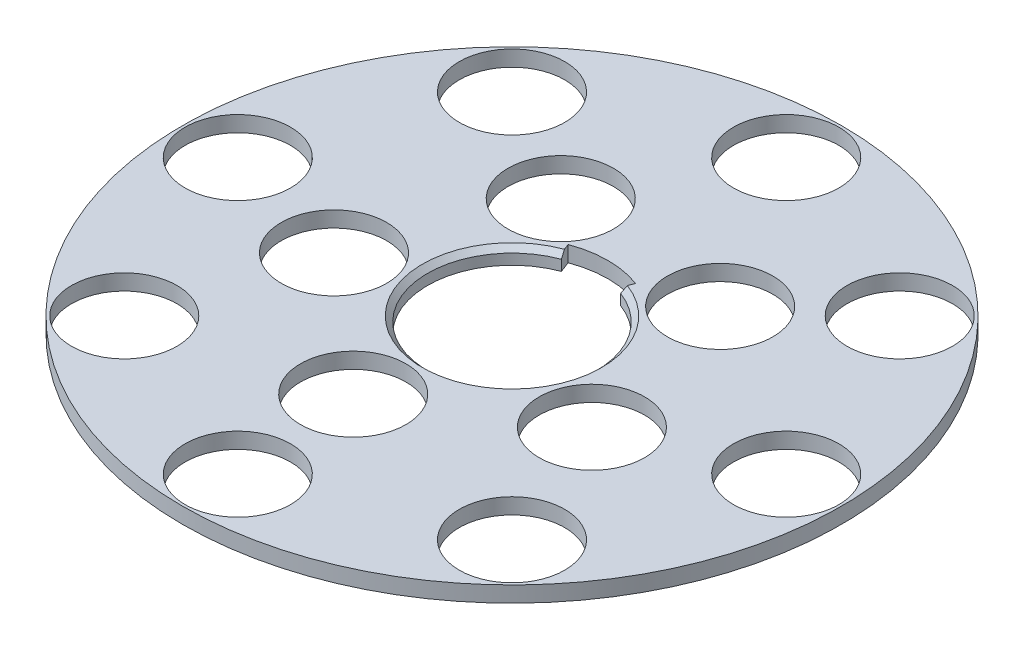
ISO-10303-21;
HEADER;
FILE_DESCRIPTION(('STEP AP214'),'2;1');
FILE_NAME('part.step','',(''),(''),'','','');
FILE_SCHEMA(('AUTOMOTIVE_DESIGN { 1 0 10303 214 1 1 1 1 }'));
ENDSEC;
DATA;
#1=APPLICATION_CONTEXT('core data for automotive mechanical design processes');
#2=APPLICATION_PROTOCOL_DEFINITION('international standard','automotive_design',2000,#1);
#3=PRODUCT_CONTEXT('',#1,'mechanical');
#4=PRODUCT('Part','Part','',(#3));
#5=PRODUCT_RELATED_PRODUCT_CATEGORY('part','',(#4));
#6=PRODUCT_DEFINITION_FORMATION('','',#4);
#7=PRODUCT_DEFINITION_CONTEXT('part definition',#1,'design');
#8=PRODUCT_DEFINITION('design','',#6,#7);
#9=PRODUCT_DEFINITION_SHAPE('','',#8);
#10=(LENGTH_UNIT() NAMED_UNIT(*) SI_UNIT(.MILLI.,.METRE.));
#11=(NAMED_UNIT(*) PLANE_ANGLE_UNIT() SI_UNIT($,.RADIAN.));
#12=(NAMED_UNIT(*) SI_UNIT($,.STERADIAN.) SOLID_ANGLE_UNIT());
#13=UNCERTAINTY_MEASURE_WITH_UNIT(LENGTH_MEASURE(1.E-05),#10,'distance_accuracy_value','');
#14=(GEOMETRIC_REPRESENTATION_CONTEXT(3) GLOBAL_UNCERTAINTY_ASSIGNED_CONTEXT((#13)) GLOBAL_UNIT_ASSIGNED_CONTEXT((#10,
#11,#12)) REPRESENTATION_CONTEXT('',''));
#15=CARTESIAN_POINT('',(0.,0.,0.));
#16=DIRECTION('',(0.,0.,1.));
#17=DIRECTION('',(1.,0.,0.));
#18=AXIS2_PLACEMENT_3D('',#15,#16,#17);
#19=CARTESIAN_POINT('',(0.,-1.5,0.));
#20=DIRECTION('',(0.,1.,0.));
#21=DIRECTION('',(0.,0.,1.));
#22=AXIS2_PLACEMENT_3D('',#19,#20,#21);
#23=CYLINDRICAL_SURFACE('',#22,31.25);
#24=CARTESIAN_POINT('',(0.,-1.5,0.));
#25=DIRECTION('',(0.,1.,0.));
#26=DIRECTION('',(0.,0.,1.));
#27=AXIS2_PLACEMENT_3D('',#24,#25,#26);
#28=CIRCLE('',#27,31.25);
#29=CARTESIAN_POINT('',(0.,-1.5,31.25));
#30=VERTEX_POINT('',#29);
#31=EDGE_CURVE('E123',#30,#30,#28,.T.);
#32=ORIENTED_EDGE('',*,*,#31,.T.);
#33=EDGE_LOOP('',(#32));
#34=FACE_BOUND('',#33,.T.);
#35=CARTESIAN_POINT('',(0.,0.,0.));
#36=DIRECTION('',(0.,1.,0.));
#37=DIRECTION('',(0.,0.,1.));
#38=AXIS2_PLACEMENT_3D('',#35,#36,#37);
#39=CIRCLE('',#38,31.25);
#40=CARTESIAN_POINT('',(0.,0.,31.25));
#41=VERTEX_POINT('',#40);
#42=EDGE_CURVE('E118',#41,#41,#39,.T.);
#43=ORIENTED_EDGE('',*,*,#42,.F.);
#44=EDGE_LOOP('',(#43));
#45=FACE_BOUND('',#44,.T.);
#46=ADVANCED_FACE('F34',(#34,#45),#23,.T.);
#47=CARTESIAN_POINT('',(0.,-1.5,0.));
#48=DIRECTION('',(0.,1.,0.));
#49=DIRECTION('',(0.,0.,1.));
#50=AXIS2_PLACEMENT_3D('',#47,#48,#49);
#51=PLANE('',#50);
#52=CARTESIAN_POINT('',(-1.09842734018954,-1.5,13.9568426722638));
#53=DIRECTION('',(0.,1.,0.));
#54=DIRECTION('',(-0.95105651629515,0.,0.309016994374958));
#55=AXIS2_PLACEMENT_3D('',#52,#53,#54);
#56=CIRCLE('',#55,5.);
#57=CARTESIAN_POINT('',(-5.85370992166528,-1.5,15.5019276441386));
#58=VERTEX_POINT('',#57);
#59=EDGE_CURVE('E217',#58,#58,#56,.T.);
#60=ORIENTED_EDGE('',*,*,#59,.T.);
#61=EDGE_LOOP('',(#60));
#62=FACE_BOUND('',#61,.T.);
#63=CARTESIAN_POINT('',(-13.6131788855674,-1.5,3.26823509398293));
#64=DIRECTION('',(0.,1.,0.));
#65=DIRECTION('',(-0.58778525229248,0.,-0.809016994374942));
#66=AXIS2_PLACEMENT_3D('',#63,#64,#65);
#67=CIRCLE('',#66,5.);
#68=CARTESIAN_POINT('',(-16.5521051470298,-1.5,-0.776849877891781));
#69=VERTEX_POINT('',#68);
#70=EDGE_CURVE('E225',#69,#69,#67,.T.);
#71=ORIENTED_EDGE('',*,*,#70,.T.);
#72=EDGE_LOOP('',(#71));
#73=FACE_BOUND('',#72,.T.);
#74=CARTESIAN_POINT('',(-7.31497990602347,-1.5,-11.9369623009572));
#75=DIRECTION('',(0.,1.,0.));
#76=DIRECTION('',(0.587785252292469,0.,-0.809016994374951));
#77=AXIS2_PLACEMENT_3D('',#74,#75,#76);
#78=CIRCLE('',#77,5.);
#79=CARTESIAN_POINT('',(-4.37605364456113,-1.5,-15.9820472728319));
#80=VERTEX_POINT('',#79);
#81=EDGE_CURVE('E231',#80,#80,#78,.T.);
#82=ORIENTED_EDGE('',*,*,#81,.T.);
#83=EDGE_LOOP('',(#82));
#84=FACE_BOUND('',#83,.T.);
#85=CARTESIAN_POINT('',(9.09227267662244,-1.5,-10.6456835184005));
#86=DIRECTION('',(0.,1.,0.));
#87=DIRECTION('',(0.951056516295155,0.,0.309016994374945));
#88=AXIS2_PLACEMENT_3D('',#85,#86,#87);
#89=CIRCLE('',#88,5.);
#90=CARTESIAN_POINT('',(13.8475552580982,-1.5,-9.10059854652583));
#91=VERTEX_POINT('',#90);
#92=EDGE_CURVE('E237',#91,#91,#89,.T.);
#93=ORIENTED_EDGE('',*,*,#92,.T.);
#94=EDGE_LOOP('',(#93));
#95=FACE_BOUND('',#94,.T.);
#96=CARTESIAN_POINT('',(12.9343134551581,-1.5,5.35756805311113));
#97=DIRECTION('',(0.,1.,0.));
#98=DIRECTION('',(0.,0.,1.));
#99=AXIS2_PLACEMENT_3D('',#96,#97,#98);
#100=CIRCLE('',#99,5.);
#101=CARTESIAN_POINT('',(12.9343134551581,-1.5,10.3575680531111));
#102=VERTEX_POINT('',#101);
#103=EDGE_CURVE('E243',#102,#102,#100,.T.);
#104=ORIENTED_EDGE('',*,*,#103,.T.);
#105=EDGE_LOOP('',(#104));
#106=FACE_BOUND('',#105,.T.);
#107=CARTESIAN_POINT('',(18.38477631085,-1.5,-18.3847763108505));
#108=DIRECTION('',(0.,1.,0.));
#109=DIRECTION('',(-0.707106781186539,0.,0.707106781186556));
#110=AXIS2_PLACEMENT_3D('',#107,#108,#109);
#111=CIRCLE('',#110,5.);
#112=CARTESIAN_POINT('',(14.8492424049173,-1.5,-14.8492424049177));
#113=VERTEX_POINT('',#112);
#114=EDGE_CURVE('E249',#113,#113,#111,.T.);
#115=ORIENTED_EDGE('',*,*,#114,.T.);
#116=EDGE_LOOP('',(#115));
#117=FACE_BOUND('',#116,.T.);
#118=CARTESIAN_POINT('',(26.,-1.5,-2.72335544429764E-13));
#119=DIRECTION('',(0.,1.,0.));
#120=DIRECTION('',(-1.,0.,0.));
#121=AXIS2_PLACEMENT_3D('',#118,#119,#120);
#122=CIRCLE('',#121,5.);
#123=CARTESIAN_POINT('',(21.,-1.5,-2.19963324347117E-13));
#124=VERTEX_POINT('',#123);
#125=EDGE_CURVE('E255',#124,#124,#122,.T.);
#126=ORIENTED_EDGE('',*,*,#125,.T.);
#127=EDGE_LOOP('',(#126));
#128=FACE_BOUND('',#127,.T.);
#129=CARTESIAN_POINT('',(18.3847763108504,-1.5,18.3847763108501));
#130=DIRECTION('',(0.,1.,0.));
#131=DIRECTION('',(-0.707106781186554,0.,-0.707106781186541));
#132=AXIS2_PLACEMENT_3D('',#129,#130,#131);
#133=CIRCLE('',#132,5.);
#134=CARTESIAN_POINT('',(14.8492424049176,-1.5,14.8492424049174));
#135=VERTEX_POINT('',#134);
#136=EDGE_CURVE('E261',#135,#135,#133,.T.);
#137=ORIENTED_EDGE('',*,*,#136,.T.);
#138=EDGE_LOOP('',(#137));
#139=FACE_BOUND('',#138,.T.);
#140=CARTESIAN_POINT('',(0.,-1.5,26.));
#141=DIRECTION('',(0.,1.,0.));
#142=DIRECTION('',(0.,0.,-1.));
#143=AXIS2_PLACEMENT_3D('',#140,#141,#142);
#144=CIRCLE('',#143,5.);
#145=CARTESIAN_POINT('',(0.,-1.5,21.));
#146=VERTEX_POINT('',#145);
#147=EDGE_CURVE('E267',#146,#146,#144,.T.);
#148=ORIENTED_EDGE('',*,*,#147,.T.);
#149=EDGE_LOOP('',(#148));
#150=FACE_BOUND('',#149,.T.);
#151=CARTESIAN_POINT('',(-18.3847763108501,-1.5,18.3847763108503));
#152=DIRECTION('',(0.,1.,0.));
#153=DIRECTION('',(0.707106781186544,0.,-0.707106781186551));
#154=AXIS2_PLACEMENT_3D('',#151,#152,#153);
#155=CIRCLE('',#154,5.);
#156=CARTESIAN_POINT('',(-14.8492424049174,-1.5,14.8492424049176));
#157=VERTEX_POINT('',#156);
#158=EDGE_CURVE('E273',#157,#157,#155,.T.);
#159=ORIENTED_EDGE('',*,*,#158,.T.);
#160=EDGE_LOOP('',(#159));
#161=FACE_BOUND('',#160,.T.);
#162=CARTESIAN_POINT('',(-26.,-1.5,0.));
#163=DIRECTION('',(0.,1.,0.));
#164=DIRECTION('',(1.,0.,0.));
#165=AXIS2_PLACEMENT_3D('',#162,#163,#164);
#166=CIRCLE('',#165,5.);
#167=CARTESIAN_POINT('',(-21.,-1.5,0.));
#168=VERTEX_POINT('',#167);
#169=EDGE_CURVE('E279',#168,#168,#166,.T.);
#170=ORIENTED_EDGE('',*,*,#169,.T.);
#171=EDGE_LOOP('',(#170));
#172=FACE_BOUND('',#171,.T.);
#173=CARTESIAN_POINT('',(-18.3847763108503,-1.5,-18.3847763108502));
#174=DIRECTION('',(0.,1.,0.));
#175=DIRECTION('',(0.707106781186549,0.,0.707106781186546));
#176=AXIS2_PLACEMENT_3D('',#173,#174,#175);
#177=CIRCLE('',#176,5.);
#178=CARTESIAN_POINT('',(-14.8492424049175,-1.5,-14.8492424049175));
#179=VERTEX_POINT('',#178);
#180=EDGE_CURVE('E285',#179,#179,#177,.T.);
#181=ORIENTED_EDGE('',*,*,#180,.T.);
#182=EDGE_LOOP('',(#181));
#183=FACE_BOUND('',#182,.T.);
#184=CARTESIAN_POINT('',(0.,-1.5,-26.));
#185=DIRECTION('',(0.,1.,0.));
#186=DIRECTION('',(0.,0.,1.));
#187=AXIS2_PLACEMENT_3D('',#184,#185,#186);
#188=CIRCLE('',#187,5.);
#189=CARTESIAN_POINT('',(0.,-1.5,-21.));
#190=VERTEX_POINT('',#189);
#191=EDGE_CURVE('E114',#190,#190,#188,.T.);
#192=ORIENTED_EDGE('',*,*,#191,.T.);
#193=EDGE_LOOP('',(#192));
#194=FACE_BOUND('',#193,.T.);
#195=CARTESIAN_POINT('',(0.,-1.5,0.));
#196=DIRECTION('',(0.,1.,0.));
#197=DIRECTION('',(0.,0.,1.));
#198=AXIS2_PLACEMENT_3D('',#195,#196,#197);
#199=CIRCLE('',#198,8.);
#200=CARTESIAN_POINT('',(-2.80898753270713,-1.5,-7.49063342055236));
#201=VERTEX_POINT('',#200);
#202=CARTESIAN_POINT('',(2.80898753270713,-1.5,-7.49063342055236));
#203=VERTEX_POINT('',#202);
#204=EDGE_CURVE('E89',#201,#203,#199,.T.);
#205=ORIENTED_EDGE('',*,*,#204,.T.);
#206=DIRECTION('',(0.351123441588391,0.,-0.936329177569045));
#207=VECTOR('',#206,1.);
#208=CARTESIAN_POINT('',(3.,-1.5,-8.));
#209=LINE('',#208,#207);
#210=CARTESIAN_POINT('',(3.19522331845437,-1.5,-8.5205955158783));
#211=VERTEX_POINT('',#210);
#212=EDGE_CURVE('E82',#203,#211,#209,.T.);
#213=ORIENTED_EDGE('',*,*,#212,.T.);
#214=CARTESIAN_POINT('',(0.,-1.5,0.));
#215=DIRECTION('',(0.,1.,0.));
#216=DIRECTION('',(0.,0.,1.));
#217=AXIS2_PLACEMENT_3D('',#214,#215,#216);
#218=CIRCLE('',#217,9.1);
#219=CARTESIAN_POINT('',(-3.19522331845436,-1.5,-8.52059551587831));
#220=VERTEX_POINT('',#219);
#221=EDGE_CURVE('E93',#211,#220,#218,.T.);
#222=ORIENTED_EDGE('',*,*,#221,.T.);
#223=DIRECTION('',(0.351123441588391,0.,0.936329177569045));
#224=VECTOR('',#223,1.);
#225=CARTESIAN_POINT('',(-3.,-1.5,-8.));
#226=LINE('',#225,#224);
#227=EDGE_CURVE('E97',#220,#201,#226,.T.);
#228=ORIENTED_EDGE('',*,*,#227,.T.);
#229=EDGE_LOOP('',(#205,#213,#222,#228));
#230=FACE_BOUND('',#229,.T.);
#231=ORIENTED_EDGE('',*,*,#31,.F.);
#232=EDGE_LOOP('',(#231));
#233=FACE_BOUND('',#232,.T.);
#234=ADVANCED_FACE('F100',(#62,#73,#84,#95,#106,#117,#128,#139,#150,#161,#172,#183,#194,#230,
#233),#51,.F.);
#235=CARTESIAN_POINT('',(0.,0.,0.));
#236=DIRECTION('',(0.,1.,0.));
#237=DIRECTION('',(0.,0.,1.));
#238=AXIS2_PLACEMENT_3D('',#235,#236,#237);
#239=PLANE('',#238);
#240=CARTESIAN_POINT('',(-1.09842734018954,0.,13.9568426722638));
#241=DIRECTION('',(0.,1.,0.));
#242=DIRECTION('',(-0.95105651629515,0.,0.309016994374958));
#243=AXIS2_PLACEMENT_3D('',#240,#241,#242);
#244=CIRCLE('',#243,5.);
#245=CARTESIAN_POINT('',(-5.85370992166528,0.,15.5019276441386));
#246=VERTEX_POINT('',#245);
#247=EDGE_CURVE('E220',#246,#246,#244,.T.);
#248=ORIENTED_EDGE('',*,*,#247,.F.);
#249=EDGE_LOOP('',(#248));
#250=FACE_BOUND('',#249,.T.);
#251=CARTESIAN_POINT('',(-13.6131788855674,0.,3.26823509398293));
#252=DIRECTION('',(0.,1.,0.));
#253=DIRECTION('',(-0.58778525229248,0.,-0.809016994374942));
#254=AXIS2_PLACEMENT_3D('',#251,#252,#253);
#255=CIRCLE('',#254,5.);
#256=CARTESIAN_POINT('',(-16.5521051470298,0.,-0.776849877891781));
#257=VERTEX_POINT('',#256);
#258=EDGE_CURVE('E222',#257,#257,#255,.T.);
#259=ORIENTED_EDGE('',*,*,#258,.F.);
#260=EDGE_LOOP('',(#259));
#261=FACE_BOUND('',#260,.T.);
#262=CARTESIAN_POINT('',(-7.31497990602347,0.,-11.9369623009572));
#263=DIRECTION('',(0.,1.,0.));
#264=DIRECTION('',(0.587785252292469,0.,-0.809016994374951));
#265=AXIS2_PLACEMENT_3D('',#262,#263,#264);
#266=CIRCLE('',#265,5.);
#267=CARTESIAN_POINT('',(-4.37605364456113,0.,-15.9820472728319));
#268=VERTEX_POINT('',#267);
#269=EDGE_CURVE('E228',#268,#268,#266,.T.);
#270=ORIENTED_EDGE('',*,*,#269,.F.);
#271=EDGE_LOOP('',(#270));
#272=FACE_BOUND('',#271,.T.);
#273=CARTESIAN_POINT('',(9.09227267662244,0.,-10.6456835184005));
#274=DIRECTION('',(0.,1.,0.));
#275=DIRECTION('',(0.951056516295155,0.,0.309016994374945));
#276=AXIS2_PLACEMENT_3D('',#273,#274,#275);
#277=CIRCLE('',#276,5.);
#278=CARTESIAN_POINT('',(13.8475552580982,0.,-9.10059854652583));
#279=VERTEX_POINT('',#278);
#280=EDGE_CURVE('E234',#279,#279,#277,.T.);
#281=ORIENTED_EDGE('',*,*,#280,.F.);
#282=EDGE_LOOP('',(#281));
#283=FACE_BOUND('',#282,.T.);
#284=CARTESIAN_POINT('',(12.9343134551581,0.,5.35756805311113));
#285=DIRECTION('',(0.,1.,0.));
#286=DIRECTION('',(0.,0.,1.));
#287=AXIS2_PLACEMENT_3D('',#284,#285,#286);
#288=CIRCLE('',#287,5.);
#289=CARTESIAN_POINT('',(12.9343134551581,0.,10.3575680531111));
#290=VERTEX_POINT('',#289);
#291=EDGE_CURVE('E240',#290,#290,#288,.T.);
#292=ORIENTED_EDGE('',*,*,#291,.F.);
#293=EDGE_LOOP('',(#292));
#294=FACE_BOUND('',#293,.T.);
#295=CARTESIAN_POINT('',(18.38477631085,0.,-18.3847763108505));
#296=DIRECTION('',(0.,1.,0.));
#297=DIRECTION('',(-0.707106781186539,0.,0.707106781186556));
#298=AXIS2_PLACEMENT_3D('',#295,#296,#297);
#299=CIRCLE('',#298,5.);
#300=CARTESIAN_POINT('',(14.8492424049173,0.,-14.8492424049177));
#301=VERTEX_POINT('',#300);
#302=EDGE_CURVE('E246',#301,#301,#299,.T.);
#303=ORIENTED_EDGE('',*,*,#302,.F.);
#304=EDGE_LOOP('',(#303));
#305=FACE_BOUND('',#304,.T.);
#306=CARTESIAN_POINT('',(26.,0.,-2.72335544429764E-13));
#307=DIRECTION('',(0.,1.,0.));
#308=DIRECTION('',(-1.,0.,0.));
#309=AXIS2_PLACEMENT_3D('',#306,#307,#308);
#310=CIRCLE('',#309,5.);
#311=CARTESIAN_POINT('',(21.,0.,-2.19963324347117E-13));
#312=VERTEX_POINT('',#311);
#313=EDGE_CURVE('E252',#312,#312,#310,.T.);
#314=ORIENTED_EDGE('',*,*,#313,.F.);
#315=EDGE_LOOP('',(#314));
#316=FACE_BOUND('',#315,.T.);
#317=CARTESIAN_POINT('',(18.3847763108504,0.,18.3847763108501));
#318=DIRECTION('',(0.,1.,0.));
#319=DIRECTION('',(-0.707106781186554,0.,-0.707106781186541));
#320=AXIS2_PLACEMENT_3D('',#317,#318,#319);
#321=CIRCLE('',#320,5.);
#322=CARTESIAN_POINT('',(14.8492424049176,0.,14.8492424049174));
#323=VERTEX_POINT('',#322);
#324=EDGE_CURVE('E258',#323,#323,#321,.T.);
#325=ORIENTED_EDGE('',*,*,#324,.F.);
#326=EDGE_LOOP('',(#325));
#327=FACE_BOUND('',#326,.T.);
#328=CARTESIAN_POINT('',(0.,0.,26.));
#329=DIRECTION('',(0.,1.,0.));
#330=DIRECTION('',(0.,0.,-1.));
#331=AXIS2_PLACEMENT_3D('',#328,#329,#330);
#332=CIRCLE('',#331,5.);
#333=CARTESIAN_POINT('',(0.,0.,21.));
#334=VERTEX_POINT('',#333);
#335=EDGE_CURVE('E264',#334,#334,#332,.T.);
#336=ORIENTED_EDGE('',*,*,#335,.F.);
#337=EDGE_LOOP('',(#336));
#338=FACE_BOUND('',#337,.T.);
#339=CARTESIAN_POINT('',(-18.3847763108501,0.,18.3847763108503));
#340=DIRECTION('',(0.,1.,0.));
#341=DIRECTION('',(0.707106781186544,0.,-0.707106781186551));
#342=AXIS2_PLACEMENT_3D('',#339,#340,#341);
#343=CIRCLE('',#342,5.);
#344=CARTESIAN_POINT('',(-14.8492424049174,0.,14.8492424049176));
#345=VERTEX_POINT('',#344);
#346=EDGE_CURVE('E270',#345,#345,#343,.T.);
#347=ORIENTED_EDGE('',*,*,#346,.F.);
#348=EDGE_LOOP('',(#347));
#349=FACE_BOUND('',#348,.T.);
#350=CARTESIAN_POINT('',(-26.,0.,0.));
#351=DIRECTION('',(0.,1.,0.));
#352=DIRECTION('',(1.,0.,0.));
#353=AXIS2_PLACEMENT_3D('',#350,#351,#352);
#354=CIRCLE('',#353,5.);
#355=CARTESIAN_POINT('',(-21.,0.,0.));
#356=VERTEX_POINT('',#355);
#357=EDGE_CURVE('E276',#356,#356,#354,.T.);
#358=ORIENTED_EDGE('',*,*,#357,.F.);
#359=EDGE_LOOP('',(#358));
#360=FACE_BOUND('',#359,.T.);
#361=CARTESIAN_POINT('',(-18.3847763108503,0.,-18.3847763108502));
#362=DIRECTION('',(0.,1.,0.));
#363=DIRECTION('',(0.707106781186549,0.,0.707106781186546));
#364=AXIS2_PLACEMENT_3D('',#361,#362,#363);
#365=CIRCLE('',#364,5.);
#366=CARTESIAN_POINT('',(-14.8492424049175,0.,-14.8492424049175));
#367=VERTEX_POINT('',#366);
#368=EDGE_CURVE('E282',#367,#367,#365,.T.);
#369=ORIENTED_EDGE('',*,*,#368,.F.);
#370=EDGE_LOOP('',(#369));
#371=FACE_BOUND('',#370,.T.);
#372=CARTESIAN_POINT('',(0.,0.,-26.));
#373=DIRECTION('',(0.,1.,0.));
#374=DIRECTION('',(0.,0.,1.));
#375=AXIS2_PLACEMENT_3D('',#372,#373,#374);
#376=CIRCLE('',#375,5.);
#377=CARTESIAN_POINT('',(0.,0.,-21.));
#378=VERTEX_POINT('',#377);
#379=EDGE_CURVE('E107',#378,#378,#376,.T.);
#380=ORIENTED_EDGE('',*,*,#379,.F.);
#381=EDGE_LOOP('',(#380));
#382=FACE_BOUND('',#381,.T.);
#383=DIRECTION('',(0.351123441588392,0.,-0.936329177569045));
#384=VECTOR('',#383,1.);
#385=CARTESIAN_POINT('',(2.80898753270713,0.,-7.49063342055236));
#386=LINE('',#385,#384);
#387=CARTESIAN_POINT('',(2.98454925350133,0.,-7.95879800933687));
#388=VERTEX_POINT('',#387);
#389=CARTESIAN_POINT('',(3.19522331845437,0.,-8.52059551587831));
#390=VERTEX_POINT('',#389);
#391=EDGE_CURVE('E84',#388,#390,#386,.T.);
#392=ORIENTED_EDGE('',*,*,#391,.F.);
#393=CARTESIAN_POINT('',(0.,0.,0.));
#394=DIRECTION('',(0.,1.,0.));
#395=DIRECTION('',(0.,0.,1.));
#396=AXIS2_PLACEMENT_3D('',#393,#394,#395);
#397=CIRCLE('',#396,8.49999999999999);
#398=CARTESIAN_POINT('',(-2.98454925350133,0.,-7.95879800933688));
#399=VERTEX_POINT('',#398);
#400=EDGE_CURVE('E42',#388,#399,#397,.F.);
#401=ORIENTED_EDGE('',*,*,#400,.T.);
#402=DIRECTION('',(0.351123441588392,0.,0.936329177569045));
#403=VECTOR('',#402,1.);
#404=CARTESIAN_POINT('',(-2.80898753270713,0.,-7.49063342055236));
#405=LINE('',#404,#403);
#406=CARTESIAN_POINT('',(-3.19522331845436,0.,-8.52059551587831));
#407=VERTEX_POINT('',#406);
#408=EDGE_CURVE('E104',#407,#399,#405,.T.);
#409=ORIENTED_EDGE('',*,*,#408,.F.);
#410=CARTESIAN_POINT('',(0.,0.,0.));
#411=DIRECTION('',(0.,1.,0.));
#412=DIRECTION('',(0.,0.,1.));
#413=AXIS2_PLACEMENT_3D('',#410,#411,#412);
#414=CIRCLE('',#413,9.1);
#415=EDGE_CURVE('E112',#390,#407,#414,.T.);
#416=ORIENTED_EDGE('',*,*,#415,.F.);
#417=EDGE_LOOP('',(#392,#401,#409,#416));
#418=FACE_BOUND('',#417,.T.);
#419=ORIENTED_EDGE('',*,*,#42,.T.);
#420=EDGE_LOOP('',(#419));
#421=FACE_BOUND('',#420,.T.);
#422=ADVANCED_FACE('F138',(#250,#261,#272,#283,#294,#305,#316,#327,#338,#349,#360,#371,#382,
#418,#421),#239,.T.);
#423=CARTESIAN_POINT('',(2.80898753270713,-1.5,-7.49063342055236));
#424=DIRECTION('',(0.936329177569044,0.,0.351123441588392));
#425=DIRECTION('',(0.351123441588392,0.,-0.936329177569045));
#426=AXIS2_PLACEMENT_3D('',#423,#424,#425);
#427=PLANE('',#426);
#428=DIRECTION('',(0.,1.,0.));
#429=VECTOR('',#428,1.);
#430=CARTESIAN_POINT('',(2.80898753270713,-1.5,-7.49063342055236));
#431=LINE('',#430,#429);
#432=CARTESIAN_POINT('',(2.80898753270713,-0.49999999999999,-7.49063342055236));
#433=VERTEX_POINT('',#432);
#434=EDGE_CURVE('E116',#203,#433,#431,.T.);
#435=ORIENTED_EDGE('',*,*,#434,.T.);
#436=DIRECTION('',(0.24828176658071,0.707106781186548,-0.662084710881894));
#437=VECTOR('',#436,1.);
#438=CARTESIAN_POINT('',(0.,-8.49999999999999,0.));
#439=LINE('',#438,#437);
#440=EDGE_CURVE('E56',#433,#388,#439,.T.);
#441=ORIENTED_EDGE('',*,*,#440,.T.);
#442=ORIENTED_EDGE('',*,*,#391,.T.);
#443=DIRECTION('',(0.,1.,0.));
#444=VECTOR('',#443,1.);
#445=CARTESIAN_POINT('',(3.19522331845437,-1.5,-8.5205955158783));
#446=LINE('',#445,#444);
#447=EDGE_CURVE('E78',#211,#390,#446,.T.);
#448=ORIENTED_EDGE('',*,*,#447,.F.);
#449=ORIENTED_EDGE('',*,*,#212,.F.);
#450=EDGE_LOOP('',(#435,#441,#442,#448,#449));
#451=FACE_BOUND('',#450,.T.);
#452=ADVANCED_FACE('F80',(#451),#427,.F.);
#453=CARTESIAN_POINT('',(0.,-1.5,0.));
#454=DIRECTION('',(0.,1.,0.));
#455=DIRECTION('',(0.,0.,1.));
#456=AXIS2_PLACEMENT_3D('',#453,#454,#455);
#457=CYLINDRICAL_SURFACE('',#456,8.);
#458=DIRECTION('',(0.,1.,0.));
#459=VECTOR('',#458,1.);
#460=CARTESIAN_POINT('',(-2.80898753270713,-1.5,-7.49063342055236));
#461=LINE('',#460,#459);
#462=CARTESIAN_POINT('',(-2.80898753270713,-0.49999999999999,-7.49063342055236));
#463=VERTEX_POINT('',#462);
#464=EDGE_CURVE('E119',#201,#463,#461,.T.);
#465=ORIENTED_EDGE('',*,*,#464,.T.);
#466=CARTESIAN_POINT('',(0.,-0.499999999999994,0.));
#467=DIRECTION('',(0.,1.,0.));
#468=DIRECTION('',(0.,0.,1.));
#469=AXIS2_PLACEMENT_3D('',#466,#467,#468);
#470=CIRCLE('',#469,8.);
#471=EDGE_CURVE('E126',#463,#433,#470,.T.);
#472=ORIENTED_EDGE('',*,*,#471,.T.);
#473=ORIENTED_EDGE('',*,*,#434,.F.);
#474=ORIENTED_EDGE('',*,*,#204,.F.);
#475=EDGE_LOOP('',(#465,#472,#473,#474));
#476=FACE_BOUND('',#475,.T.);
#477=ADVANCED_FACE('F133',(#476),#457,.F.);
#478=CARTESIAN_POINT('',(-2.80898753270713,-1.5,-7.49063342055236));
#479=DIRECTION('',(-0.936329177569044,0.,0.351123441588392));
#480=DIRECTION('',(0.351123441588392,0.,0.936329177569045));
#481=AXIS2_PLACEMENT_3D('',#478,#479,#480);
#482=PLANE('',#481);
#483=ORIENTED_EDGE('',*,*,#408,.T.);
#484=DIRECTION('',(0.24828176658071,-0.707106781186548,0.662084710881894));
#485=VECTOR('',#484,1.);
#486=CARTESIAN_POINT('',(0.,-8.49999999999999,0.));
#487=LINE('',#486,#485);
#488=EDGE_CURVE('E11',#399,#463,#487,.T.);
#489=ORIENTED_EDGE('',*,*,#488,.T.);
#490=ORIENTED_EDGE('',*,*,#464,.F.);
#491=ORIENTED_EDGE('',*,*,#227,.F.);
#492=DIRECTION('',(0.,1.,0.));
#493=VECTOR('',#492,1.);
#494=CARTESIAN_POINT('',(-3.19522331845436,-1.5,-8.52059551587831));
#495=LINE('',#494,#493);
#496=EDGE_CURVE('E88',#220,#407,#495,.T.);
#497=ORIENTED_EDGE('',*,*,#496,.T.);
#498=EDGE_LOOP('',(#483,#489,#490,#491,#497));
#499=FACE_BOUND('',#498,.T.);
#500=ADVANCED_FACE('F137',(#499),#482,.F.);
#501=CARTESIAN_POINT('',(0.,-1.5,0.));
#502=DIRECTION('',(0.,1.,0.));
#503=DIRECTION('',(0.,0.,1.));
#504=AXIS2_PLACEMENT_3D('',#501,#502,#503);
#505=CYLINDRICAL_SURFACE('',#504,9.1);
#506=ORIENTED_EDGE('',*,*,#415,.T.);
#507=ORIENTED_EDGE('',*,*,#496,.F.);
#508=ORIENTED_EDGE('',*,*,#221,.F.);
#509=ORIENTED_EDGE('',*,*,#447,.T.);
#510=EDGE_LOOP('',(#506,#507,#508,#509));
#511=FACE_BOUND('',#510,.T.);
#512=ADVANCED_FACE('F94',(#511),#505,.F.);
#513=CARTESIAN_POINT('',(0.,-0.499999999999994,0.));
#514=DIRECTION('',(0.,1.,0.));
#515=DIRECTION('',(0.,0.,1.));
#516=AXIS2_PLACEMENT_3D('',#513,#514,#515);
#517=CONICAL_SURFACE('',#516,8.,0.785398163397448);
#518=ORIENTED_EDGE('',*,*,#488,.F.);
#519=ORIENTED_EDGE('',*,*,#400,.F.);
#520=ORIENTED_EDGE('',*,*,#440,.F.);
#521=ORIENTED_EDGE('',*,*,#471,.F.);
#522=EDGE_LOOP('',(#518,#519,#520,#521));
#523=FACE_BOUND('',#522,.T.);
#524=ADVANCED_FACE('F36',(#523),#517,.F.);
#525=CARTESIAN_POINT('',(0.,-1.5,-26.));
#526=DIRECTION('',(0.,1.,0.));
#527=DIRECTION('',(0.,0.,1.));
#528=AXIS2_PLACEMENT_3D('',#525,#526,#527);
#529=CYLINDRICAL_SURFACE('',#528,5.);
#530=ORIENTED_EDGE('',*,*,#191,.F.);
#531=EDGE_LOOP('',(#530));
#532=FACE_BOUND('',#531,.T.);
#533=ORIENTED_EDGE('',*,*,#379,.T.);
#534=EDGE_LOOP('',(#533));
#535=FACE_BOUND('',#534,.T.);
#536=ADVANCED_FACE('F161',(#532,#535),#529,.F.);
#537=CARTESIAN_POINT('',(-18.3847763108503,-1.5,-18.3847763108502));
#538=DIRECTION('',(0.,1.,0.));
#539=DIRECTION('',(0.,0.,1.));
#540=AXIS2_PLACEMENT_3D('',#537,#538,#539);
#541=CYLINDRICAL_SURFACE('',#540,5.);
#542=ORIENTED_EDGE('',*,*,#180,.F.);
#543=EDGE_LOOP('',(#542));
#544=FACE_BOUND('',#543,.T.);
#545=ORIENTED_EDGE('',*,*,#368,.T.);
#546=EDGE_LOOP('',(#545));
#547=FACE_BOUND('',#546,.T.);
#548=ADVANCED_FACE('F164',(#544,#547),#541,.F.);
#549=CARTESIAN_POINT('',(-26.,-1.5,0.));
#550=DIRECTION('',(0.,1.,0.));
#551=DIRECTION('',(0.,0.,1.));
#552=AXIS2_PLACEMENT_3D('',#549,#550,#551);
#553=CYLINDRICAL_SURFACE('',#552,5.);
#554=ORIENTED_EDGE('',*,*,#169,.F.);
#555=EDGE_LOOP('',(#554));
#556=FACE_BOUND('',#555,.T.);
#557=ORIENTED_EDGE('',*,*,#357,.T.);
#558=EDGE_LOOP('',(#557));
#559=FACE_BOUND('',#558,.T.);
#560=ADVANCED_FACE('F168',(#556,#559),#553,.F.);
#561=CARTESIAN_POINT('',(-18.3847763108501,-1.5,18.3847763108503));
#562=DIRECTION('',(0.,1.,0.));
#563=DIRECTION('',(0.,0.,1.));
#564=AXIS2_PLACEMENT_3D('',#561,#562,#563);
#565=CYLINDRICAL_SURFACE('',#564,5.);
#566=ORIENTED_EDGE('',*,*,#158,.F.);
#567=EDGE_LOOP('',(#566));
#568=FACE_BOUND('',#567,.T.);
#569=ORIENTED_EDGE('',*,*,#346,.T.);
#570=EDGE_LOOP('',(#569));
#571=FACE_BOUND('',#570,.T.);
#572=ADVANCED_FACE('F172',(#568,#571),#565,.F.);
#573=CARTESIAN_POINT('',(0.,-1.5,26.));
#574=DIRECTION('',(0.,1.,0.));
#575=DIRECTION('',(0.,0.,1.));
#576=AXIS2_PLACEMENT_3D('',#573,#574,#575);
#577=CYLINDRICAL_SURFACE('',#576,5.);
#578=ORIENTED_EDGE('',*,*,#147,.F.);
#579=EDGE_LOOP('',(#578));
#580=FACE_BOUND('',#579,.T.);
#581=ORIENTED_EDGE('',*,*,#335,.T.);
#582=EDGE_LOOP('',(#581));
#583=FACE_BOUND('',#582,.T.);
#584=ADVANCED_FACE('F176',(#580,#583),#577,.F.);
#585=CARTESIAN_POINT('',(18.3847763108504,-1.5,18.3847763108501));
#586=DIRECTION('',(0.,1.,0.));
#587=DIRECTION('',(0.,0.,1.));
#588=AXIS2_PLACEMENT_3D('',#585,#586,#587);
#589=CYLINDRICAL_SURFACE('',#588,5.);
#590=ORIENTED_EDGE('',*,*,#136,.F.);
#591=EDGE_LOOP('',(#590));
#592=FACE_BOUND('',#591,.T.);
#593=ORIENTED_EDGE('',*,*,#324,.T.);
#594=EDGE_LOOP('',(#593));
#595=FACE_BOUND('',#594,.T.);
#596=ADVANCED_FACE('F180',(#592,#595),#589,.F.);
#597=CARTESIAN_POINT('',(26.,-1.5,-2.72335544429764E-13));
#598=DIRECTION('',(0.,1.,0.));
#599=DIRECTION('',(0.,0.,1.));
#600=AXIS2_PLACEMENT_3D('',#597,#598,#599);
#601=CYLINDRICAL_SURFACE('',#600,5.);
#602=ORIENTED_EDGE('',*,*,#125,.F.);
#603=EDGE_LOOP('',(#602));
#604=FACE_BOUND('',#603,.T.);
#605=ORIENTED_EDGE('',*,*,#313,.T.);
#606=EDGE_LOOP('',(#605));
#607=FACE_BOUND('',#606,.T.);
#608=ADVANCED_FACE('F184',(#604,#607),#601,.F.);
#609=CARTESIAN_POINT('',(18.38477631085,-1.5,-18.3847763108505));
#610=DIRECTION('',(0.,1.,0.));
#611=DIRECTION('',(0.,0.,1.));
#612=AXIS2_PLACEMENT_3D('',#609,#610,#611);
#613=CYLINDRICAL_SURFACE('',#612,5.);
#614=ORIENTED_EDGE('',*,*,#114,.F.);
#615=EDGE_LOOP('',(#614));
#616=FACE_BOUND('',#615,.T.);
#617=ORIENTED_EDGE('',*,*,#302,.T.);
#618=EDGE_LOOP('',(#617));
#619=FACE_BOUND('',#618,.T.);
#620=ADVANCED_FACE('F188',(#616,#619),#613,.F.);
#621=CARTESIAN_POINT('',(12.9343134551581,-1.5,5.35756805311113));
#622=DIRECTION('',(0.,1.,0.));
#623=DIRECTION('',(0.,0.,1.));
#624=AXIS2_PLACEMENT_3D('',#621,#622,#623);
#625=CYLINDRICAL_SURFACE('',#624,5.);
#626=ORIENTED_EDGE('',*,*,#103,.F.);
#627=EDGE_LOOP('',(#626));
#628=FACE_BOUND('',#627,.T.);
#629=ORIENTED_EDGE('',*,*,#291,.T.);
#630=EDGE_LOOP('',(#629));
#631=FACE_BOUND('',#630,.T.);
#632=ADVANCED_FACE('F192',(#628,#631),#625,.F.);
#633=CARTESIAN_POINT('',(9.09227267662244,-1.5,-10.6456835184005));
#634=DIRECTION('',(0.,1.,0.));
#635=DIRECTION('',(0.,0.,1.));
#636=AXIS2_PLACEMENT_3D('',#633,#634,#635);
#637=CYLINDRICAL_SURFACE('',#636,5.);
#638=ORIENTED_EDGE('',*,*,#92,.F.);
#639=EDGE_LOOP('',(#638));
#640=FACE_BOUND('',#639,.T.);
#641=ORIENTED_EDGE('',*,*,#280,.T.);
#642=EDGE_LOOP('',(#641));
#643=FACE_BOUND('',#642,.T.);
#644=ADVANCED_FACE('F196',(#640,#643),#637,.F.);
#645=CARTESIAN_POINT('',(-7.31497990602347,-1.5,-11.9369623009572));
#646=DIRECTION('',(0.,1.,0.));
#647=DIRECTION('',(0.,0.,1.));
#648=AXIS2_PLACEMENT_3D('',#645,#646,#647);
#649=CYLINDRICAL_SURFACE('',#648,5.);
#650=ORIENTED_EDGE('',*,*,#81,.F.);
#651=EDGE_LOOP('',(#650));
#652=FACE_BOUND('',#651,.T.);
#653=ORIENTED_EDGE('',*,*,#269,.T.);
#654=EDGE_LOOP('',(#653));
#655=FACE_BOUND('',#654,.T.);
#656=ADVANCED_FACE('F200',(#652,#655),#649,.F.);
#657=CARTESIAN_POINT('',(-13.6131788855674,-1.5,3.26823509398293));
#658=DIRECTION('',(0.,1.,0.));
#659=DIRECTION('',(0.,0.,1.));
#660=AXIS2_PLACEMENT_3D('',#657,#658,#659);
#661=CYLINDRICAL_SURFACE('',#660,5.);
#662=ORIENTED_EDGE('',*,*,#70,.F.);
#663=EDGE_LOOP('',(#662));
#664=FACE_BOUND('',#663,.T.);
#665=ORIENTED_EDGE('',*,*,#258,.T.);
#666=EDGE_LOOP('',(#665));
#667=FACE_BOUND('',#666,.T.);
#668=ADVANCED_FACE('F204',(#664,#667),#661,.F.);
#669=CARTESIAN_POINT('',(-1.09842734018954,-1.5,13.9568426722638));
#670=DIRECTION('',(0.,1.,0.));
#671=DIRECTION('',(0.,0.,1.));
#672=AXIS2_PLACEMENT_3D('',#669,#670,#671);
#673=CYLINDRICAL_SURFACE('',#672,5.);
#674=ORIENTED_EDGE('',*,*,#59,.F.);
#675=EDGE_LOOP('',(#674));
#676=FACE_BOUND('',#675,.T.);
#677=ORIENTED_EDGE('',*,*,#247,.T.);
#678=EDGE_LOOP('',(#677));
#679=FACE_BOUND('',#678,.T.);
#680=ADVANCED_FACE('F208',(#676,#679),#673,.F.);
#681=CLOSED_SHELL('',(#46,#234,#422,#452,#477,#500,#512,#524,#536,#548,#560,#572,#584,#596,#608,
#620,#632,#644,#656,#668,#680));
#682=MANIFOLD_SOLID_BREP('B2',#681);
#683=ADVANCED_BREP_SHAPE_REPRESENTATION('',(#18,#682),#14);
#684=SHAPE_DEFINITION_REPRESENTATION(#9,#683);
ENDSEC;
END-ISO-10303-21;
